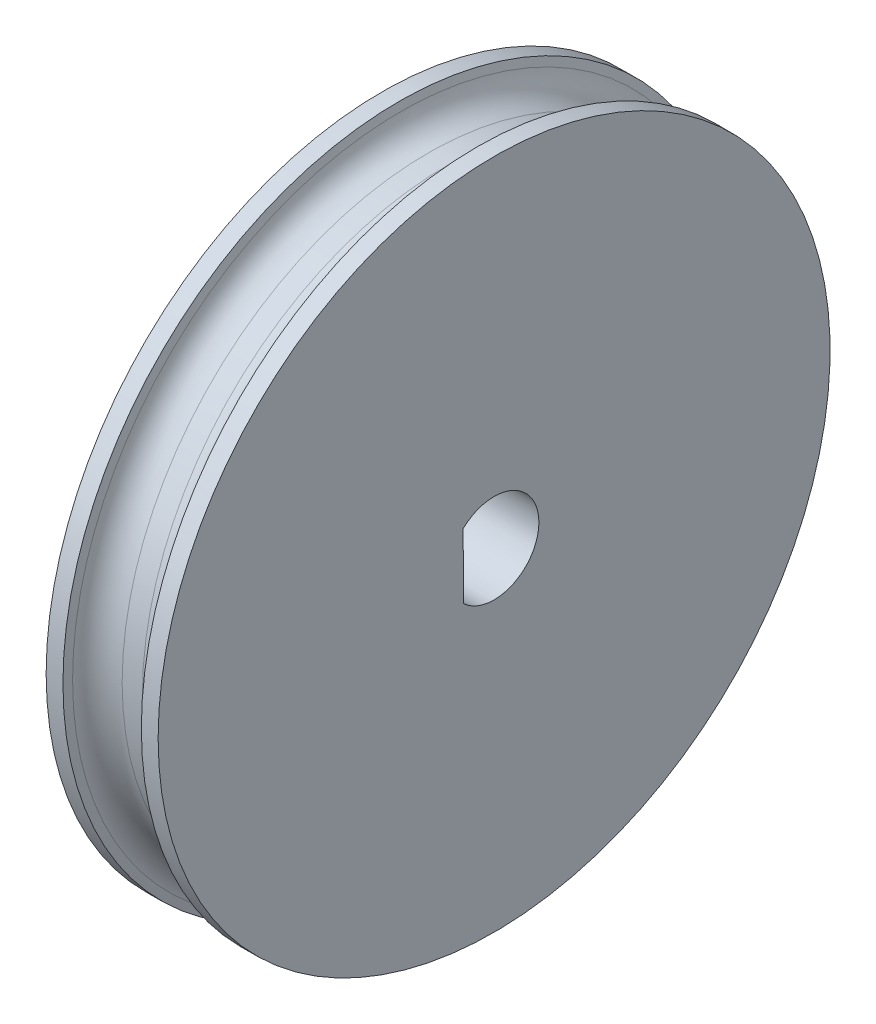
ISO-10303-21;
HEADER;
FILE_DESCRIPTION(('STEP AP214'),'2;1');
FILE_NAME('part.step','',(''),(''),'','','');
FILE_SCHEMA(('AUTOMOTIVE_DESIGN { 1 0 10303 214 1 1 1 1 }'));
ENDSEC;
DATA;
#1=APPLICATION_CONTEXT('core data for automotive mechanical design processes');
#2=APPLICATION_PROTOCOL_DEFINITION('international standard','automotive_design',2000,#1);
#3=PRODUCT_CONTEXT('',#1,'mechanical');
#4=PRODUCT('Part','Part','',(#3));
#5=PRODUCT_RELATED_PRODUCT_CATEGORY('part','',(#4));
#6=PRODUCT_DEFINITION_FORMATION('','',#4);
#7=PRODUCT_DEFINITION_CONTEXT('part definition',#1,'design');
#8=PRODUCT_DEFINITION('design','',#6,#7);
#9=PRODUCT_DEFINITION_SHAPE('','',#8);
#10=(LENGTH_UNIT() NAMED_UNIT(*) SI_UNIT(.MILLI.,.METRE.));
#11=(NAMED_UNIT(*) PLANE_ANGLE_UNIT() SI_UNIT($,.RADIAN.));
#12=(NAMED_UNIT(*) SI_UNIT($,.STERADIAN.) SOLID_ANGLE_UNIT());
#13=UNCERTAINTY_MEASURE_WITH_UNIT(LENGTH_MEASURE(1.E-05),#10,'distance_accuracy_value','');
#14=(GEOMETRIC_REPRESENTATION_CONTEXT(3) GLOBAL_UNCERTAINTY_ASSIGNED_CONTEXT((#13)) GLOBAL_UNIT_ASSIGNED_CONTEXT((#10,
#11,#12)) REPRESENTATION_CONTEXT('',''));
#15=CARTESIAN_POINT('',(0.,0.,0.));
#16=DIRECTION('',(0.,0.,1.));
#17=DIRECTION('',(1.,0.,0.));
#18=AXIS2_PLACEMENT_3D('',#15,#16,#17);
#19=CARTESIAN_POINT('',(-1.1712000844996,0.117251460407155,0.));
#20=DIRECTION('',(-1.,0.,0.));
#21=DIRECTION('',(0.,0.,1.));
#22=AXIS2_PLACEMENT_3D('',#19,#20,#21);
#23=CONICAL_SURFACE('',#22,10.9240376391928,1.36135681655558);
#24=CARTESIAN_POINT('',(-1.33956365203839,0.117251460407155,0.));
#25=DIRECTION('',(-1.,0.,0.));
#26=DIRECTION('',(0.,0.,1.));
#27=AXIS2_PLACEMENT_3D('',#24,#25,#26);
#28=CIRCLE('',#27,11.7161259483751);
#29=CARTESIAN_POINT('',(-1.33956365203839,0.117251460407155,11.7161259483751));
#30=VERTEX_POINT('',#29);
#31=EDGE_CURVE('E93',#30,#30,#28,.T.);
#32=ORIENTED_EDGE('',*,*,#31,.T.);
#33=EDGE_LOOP('',(#32));
#34=FACE_BOUND('',#33,.T.);
#35=CARTESIAN_POINT('',(-1.39990294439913,0.117251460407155,0.));
#36=DIRECTION('',(-1.,0.,0.));
#37=DIRECTION('',(0.,0.,1.));
#38=AXIS2_PLACEMENT_3D('',#35,#36,#37);
#39=CIRCLE('',#38,12.);
#40=CARTESIAN_POINT('',(-1.39990294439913,0.117251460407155,12.));
#41=VERTEX_POINT('',#40);
#42=EDGE_CURVE('E90',#41,#41,#39,.T.);
#43=ORIENTED_EDGE('',*,*,#42,.F.);
#44=EDGE_LOOP('',(#43));
#45=FACE_BOUND('',#44,.T.);
#46=ADVANCED_FACE('F35',(#34,#45),#23,.T.);
#47=CARTESIAN_POINT('',(-22.6859186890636,0.117251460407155,0.));
#48=DIRECTION('',(-1.,0.,0.));
#49=DIRECTION('',(0.,0.,1.));
#50=AXIS2_PLACEMENT_3D('',#47,#48,#49);
#51=CYLINDRICAL_SURFACE('',#50,12.);
#52=CARTESIAN_POINT('',(-1.99990294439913,0.117251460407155,0.));
#53=DIRECTION('',(-1.,0.,0.));
#54=DIRECTION('',(0.,0.,1.));
#55=AXIS2_PLACEMENT_3D('',#52,#53,#54);
#56=CIRCLE('',#55,12.);
#57=CARTESIAN_POINT('',(-1.99990294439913,0.117251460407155,12.));
#58=VERTEX_POINT('',#57);
#59=EDGE_CURVE('E87',#58,#58,#56,.T.);
#60=ORIENTED_EDGE('',*,*,#59,.F.);
#61=EDGE_LOOP('',(#60));
#62=FACE_BOUND('',#61,.T.);
#63=ORIENTED_EDGE('',*,*,#42,.T.);
#64=EDGE_LOOP('',(#63));
#65=FACE_BOUND('',#64,.T.);
#66=ADVANCED_FACE('F113',(#62,#65),#51,.T.);
#67=CARTESIAN_POINT('',(-1.99990294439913,0.117251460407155,0.));
#68=DIRECTION('',(1.,0.,0.));
#69=DIRECTION('',(0.,0.,-1.));
#70=AXIS2_PLACEMENT_3D('',#67,#68,#69);
#71=PLANE('',#70);
#72=CARTESIAN_POINT('',(-1.99990294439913,0.,0.));
#73=DIRECTION('',(1.,0.,0.));
#74=DIRECTION('',(0.,0.,-1.));
#75=AXIS2_PLACEMENT_3D('',#72,#73,#74);
#76=CIRCLE('',#75,4.5);
#77=CARTESIAN_POINT('',(-1.99990294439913,0.,-4.5));
#78=VERTEX_POINT('',#77);
#79=EDGE_CURVE('E43',#78,#78,#76,.F.);
#80=ORIENTED_EDGE('',*,*,#79,.F.);
#81=EDGE_LOOP('',(#80));
#82=FACE_BOUND('',#81,.T.);
#83=ORIENTED_EDGE('',*,*,#59,.T.);
#84=EDGE_LOOP('',(#83));
#85=FACE_BOUND('',#84,.T.);
#86=ADVANCED_FACE('F109',(#82,#85),#71,.F.);
#87=CARTESIAN_POINT('',(2.00009705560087,12.1172514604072,0.));
#88=DIRECTION('',(-1.,0.,0.));
#89=DIRECTION('',(0.,0.,1.));
#90=AXIS2_PLACEMENT_3D('',#87,#88,#89);
#91=PLANE('',#90);
#92=DIRECTION('',(0.,0.999991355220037,0.0041580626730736));
#93=VECTOR('',#92,1.);
#94=CARTESIAN_POINT('',(2.00009705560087,12.1124680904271,1.1503743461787));
#95=LINE('',#94,#93);
#96=CARTESIAN_POINT('',(2.00009705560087,-1.16645882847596,1.09515925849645));
#97=VERTEX_POINT('',#96);
#98=CARTESIAN_POINT('',(2.00009705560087,1.1573110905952,1.10482172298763));
#99=VERTEX_POINT('',#98);
#100=EDGE_CURVE('E66',#97,#99,#95,.T.);
#101=ORIENTED_EDGE('',*,*,#100,.T.);
#102=CARTESIAN_POINT('',(2.00009705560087,0.,0.));
#103=DIRECTION('',(-1.,0.,0.));
#104=DIRECTION('',(0.,0.,1.));
#105=AXIS2_PLACEMENT_3D('',#102,#103,#104);
#106=CIRCLE('',#105,1.6);
#107=EDGE_CURVE('E64',#99,#97,#106,.T.);
#108=ORIENTED_EDGE('',*,*,#107,.T.);
#109=EDGE_LOOP('',(#101,#108));
#110=FACE_BOUND('',#109,.T.);
#111=CARTESIAN_POINT('',(2.00009705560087,0.117251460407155,0.));
#112=DIRECTION('',(-1.,0.,0.));
#113=DIRECTION('',(0.,0.,1.));
#114=AXIS2_PLACEMENT_3D('',#111,#112,#113);
#115=CIRCLE('',#114,12.);
#116=CARTESIAN_POINT('',(2.00009705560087,0.117251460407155,12.));
#117=VERTEX_POINT('',#116);
#118=EDGE_CURVE('E84',#117,#117,#115,.T.);
#119=ORIENTED_EDGE('',*,*,#118,.F.);
#120=EDGE_LOOP('',(#119));
#121=FACE_BOUND('',#120,.T.);
#122=ADVANCED_FACE('F112',(#110,#121),#91,.F.);
#123=CARTESIAN_POINT('',(-22.6859186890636,0.117251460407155,0.));
#124=DIRECTION('',(-1.,0.,0.));
#125=DIRECTION('',(0.,0.,1.));
#126=AXIS2_PLACEMENT_3D('',#123,#124,#125);
#127=CYLINDRICAL_SURFACE('',#126,12.);
#128=CARTESIAN_POINT('',(1.40009705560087,0.117251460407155,0.));
#129=DIRECTION('',(-1.,0.,0.));
#130=DIRECTION('',(0.,0.,1.));
#131=AXIS2_PLACEMENT_3D('',#128,#129,#130);
#132=CIRCLE('',#131,12.);
#133=CARTESIAN_POINT('',(1.40009705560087,0.117251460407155,12.));
#134=VERTEX_POINT('',#133);
#135=EDGE_CURVE('E81',#134,#134,#132,.T.);
#136=ORIENTED_EDGE('',*,*,#135,.F.);
#137=EDGE_LOOP('',(#136));
#138=FACE_BOUND('',#137,.T.);
#139=ORIENTED_EDGE('',*,*,#118,.T.);
#140=EDGE_LOOP('',(#139));
#141=FACE_BOUND('',#140,.T.);
#142=ADVANCED_FACE('F150',(#138,#141),#127,.T.);
#143=CARTESIAN_POINT('',(1.40009705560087,0.117251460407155,0.));
#144=DIRECTION('',(1.,0.,0.));
#145=DIRECTION('',(0.,0.,-1.));
#146=AXIS2_PLACEMENT_3D('',#143,#144,#145);
#147=CONICAL_SURFACE('',#146,12.,1.36135681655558);
#148=CARTESIAN_POINT('',(1.33975776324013,0.117251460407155,0.));
#149=DIRECTION('',(1.,0.,0.));
#150=DIRECTION('',(0.,0.,-1.));
#151=AXIS2_PLACEMENT_3D('',#148,#149,#150);
#152=CIRCLE('',#151,11.7161259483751);
#153=CARTESIAN_POINT('',(1.33975776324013,0.117251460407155,-11.7161259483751));
#154=VERTEX_POINT('',#153);
#155=EDGE_CURVE('E102',#154,#154,#152,.T.);
#156=ORIENTED_EDGE('',*,*,#155,.T.);
#157=EDGE_LOOP('',(#156));
#158=FACE_BOUND('',#157,.T.);
#159=ORIENTED_EDGE('',*,*,#135,.T.);
#160=EDGE_LOOP('',(#159));
#161=FACE_BOUND('',#160,.T.);
#162=ADVANCED_FACE('F144',(#158,#161),#147,.T.);
#163=CARTESIAN_POINT('',(-22.6859186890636,0.117251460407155,0.));
#164=DIRECTION('',(-1.,0.,0.));
#165=DIRECTION('',(0.,0.,1.));
#166=AXIS2_PLACEMENT_3D('',#163,#164,#165);
#167=CYLINDRICAL_SURFACE('',#166,10.9240376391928);
#168=CARTESIAN_POINT('',(-0.361416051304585,0.117251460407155,0.));
#169=DIRECTION('',(-1.,0.,0.));
#170=DIRECTION('',(0.,0.,1.));
#171=AXIS2_PLACEMENT_3D('',#168,#169,#170);
#172=CIRCLE('',#171,10.9240376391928);
#173=CARTESIAN_POINT('',(-0.361416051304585,0.117251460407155,10.9240376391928));
#174=VERTEX_POINT('',#173);
#175=EDGE_CURVE('E99',#174,#174,#172,.F.);
#176=ORIENTED_EDGE('',*,*,#175,.T.);
#177=EDGE_LOOP('',(#176));
#178=FACE_BOUND('',#177,.T.);
#179=CARTESIAN_POINT('',(0.361610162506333,0.117251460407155,0.));
#180=DIRECTION('',(-1.,0.,0.));
#181=DIRECTION('',(0.,0.,1.));
#182=AXIS2_PLACEMENT_3D('',#179,#180,#181);
#183=CIRCLE('',#182,10.9240376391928);
#184=CARTESIAN_POINT('',(0.361610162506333,0.117251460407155,10.9240376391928));
#185=VERTEX_POINT('',#184);
#186=EDGE_CURVE('E96',#185,#185,#183,.T.);
#187=ORIENTED_EDGE('',*,*,#186,.T.);
#188=EDGE_LOOP('',(#187));
#189=FACE_BOUND('',#188,.T.);
#190=ADVANCED_FACE('F131',(#178,#189),#167,.T.);
#191=CARTESIAN_POINT('',(-0.361416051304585,0.117251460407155,0.));
#192=DIRECTION('',(-1.,0.,0.));
#193=DIRECTION('',(0.,0.,1.));
#194=AXIS2_PLACEMENT_3D('',#191,#192,#193);
#195=TOROIDAL_SURFACE('',#194,11.9240376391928,1.);
#196=ORIENTED_EDGE('',*,*,#175,.F.);
#197=EDGE_LOOP('',(#196));
#198=FACE_BOUND('',#197,.T.);
#199=ORIENTED_EDGE('',*,*,#31,.F.);
#200=EDGE_LOOP('',(#199));
#201=FACE_BOUND('',#200,.T.);
#202=ADVANCED_FACE('F128',(#198,#201),#195,.F.);
#203=CARTESIAN_POINT('',(0.361610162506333,0.117251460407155,0.));
#204=DIRECTION('',(-1.,0.,0.));
#205=DIRECTION('',(0.,0.,1.));
#206=AXIS2_PLACEMENT_3D('',#203,#204,#205);
#207=TOROIDAL_SURFACE('',#206,11.9240376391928,1.);
#208=ORIENTED_EDGE('',*,*,#155,.F.);
#209=EDGE_LOOP('',(#208));
#210=FACE_BOUND('',#209,.T.);
#211=ORIENTED_EDGE('',*,*,#186,.F.);
#212=EDGE_LOOP('',(#211));
#213=FACE_BOUND('',#212,.T.);
#214=ADVANCED_FACE('F130',(#210,#213),#207,.F.);
#215=CARTESIAN_POINT('',(-2.49990294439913,0.,0.));
#216=DIRECTION('',(-1.,0.,0.));
#217=DIRECTION('',(0.,0.,1.));
#218=AXIS2_PLACEMENT_3D('',#215,#216,#217);
#219=PLANE('',#218);
#220=CARTESIAN_POINT('',(-2.49990294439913,0.,0.));
#221=DIRECTION('',(-1.,0.,0.));
#222=DIRECTION('',(0.,0.,1.));
#223=AXIS2_PLACEMENT_3D('',#220,#221,#222);
#224=CIRCLE('',#223,1.6);
#225=CARTESIAN_POINT('',(-2.49990294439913,1.1573110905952,1.10482172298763));
#226=VERTEX_POINT('',#225);
#227=CARTESIAN_POINT('',(-2.49990294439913,-1.16645882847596,1.09515925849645));
#228=VERTEX_POINT('',#227);
#229=EDGE_CURVE('E57',#226,#228,#224,.T.);
#230=ORIENTED_EDGE('',*,*,#229,.F.);
#231=DIRECTION('',(0.,0.999991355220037,0.0041580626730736));
#232=VECTOR('',#231,1.);
#233=CARTESIAN_POINT('',(-2.49990294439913,-1.16645882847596,1.09515925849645));
#234=LINE('',#233,#232);
#235=EDGE_CURVE('E70',#228,#226,#234,.T.);
#236=ORIENTED_EDGE('',*,*,#235,.F.);
#237=EDGE_LOOP('',(#230,#236));
#238=FACE_BOUND('',#237,.T.);
#239=CARTESIAN_POINT('',(-2.49990294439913,0.,0.));
#240=DIRECTION('',(-1.,0.,0.));
#241=DIRECTION('',(0.,0.,1.));
#242=AXIS2_PLACEMENT_3D('',#239,#240,#241);
#243=CIRCLE('',#242,4.);
#244=CARTESIAN_POINT('',(-2.49990294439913,0.,4.));
#245=VERTEX_POINT('',#244);
#246=EDGE_CURVE('E11',#245,#245,#243,.T.);
#247=ORIENTED_EDGE('',*,*,#246,.T.);
#248=EDGE_LOOP('',(#247));
#249=FACE_BOUND('',#248,.T.);
#250=ADVANCED_FACE('F74',(#238,#249),#219,.T.);
#251=CARTESIAN_POINT('',(-1.99990294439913,0.,0.));
#252=DIRECTION('',(-1.,0.,0.));
#253=DIRECTION('',(0.,0.,1.));
#254=AXIS2_PLACEMENT_3D('',#251,#252,#253);
#255=TOROIDAL_SURFACE('',#254,4.,0.5);
#256=ORIENTED_EDGE('',*,*,#79,.T.);
#257=EDGE_LOOP('',(#256));
#258=FACE_BOUND('',#257,.T.);
#259=ORIENTED_EDGE('',*,*,#246,.F.);
#260=EDGE_LOOP('',(#259));
#261=FACE_BOUND('',#260,.T.);
#262=ADVANCED_FACE('F37',(#258,#261),#255,.T.);
#263=CARTESIAN_POINT('',(7.50009705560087,0.,0.));
#264=DIRECTION('',(-1.,0.,0.));
#265=DIRECTION('',(0.,0.,1.));
#266=AXIS2_PLACEMENT_3D('',#263,#264,#265);
#267=CYLINDRICAL_SURFACE('',#266,1.6);
#268=DIRECTION('',(-1.,0.,0.));
#269=VECTOR('',#268,1.);
#270=CARTESIAN_POINT('',(7.50009705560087,1.1573110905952,1.10482172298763));
#271=LINE('',#270,#269);
#272=EDGE_CURVE('E50',#99,#226,#271,.T.);
#273=ORIENTED_EDGE('',*,*,#272,.T.);
#274=ORIENTED_EDGE('',*,*,#229,.T.);
#275=DIRECTION('',(-1.,0.,0.));
#276=VECTOR('',#275,1.);
#277=CARTESIAN_POINT('',(7.50009705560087,-1.16645882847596,1.09515925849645));
#278=LINE('',#277,#276);
#279=EDGE_CURVE('E67',#97,#228,#278,.T.);
#280=ORIENTED_EDGE('',*,*,#279,.F.);
#281=ORIENTED_EDGE('',*,*,#107,.F.);
#282=EDGE_LOOP('',(#273,#274,#280,#281));
#283=FACE_BOUND('',#282,.T.);
#284=ADVANCED_FACE('F62',(#283),#267,.F.);
#285=CARTESIAN_POINT('',(7.50009705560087,-1.16645882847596,1.09515925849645));
#286=DIRECTION('',(0.,-0.0041580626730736,0.999991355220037));
#287=DIRECTION('',(0.,-0.999991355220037,-0.0041580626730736));
#288=AXIS2_PLACEMENT_3D('',#285,#286,#287);
#289=PLANE('',#288);
#290=ORIENTED_EDGE('',*,*,#279,.T.);
#291=ORIENTED_EDGE('',*,*,#235,.T.);
#292=ORIENTED_EDGE('',*,*,#272,.F.);
#293=ORIENTED_EDGE('',*,*,#100,.F.);
#294=EDGE_LOOP('',(#290,#291,#292,#293));
#295=FACE_BOUND('',#294,.T.);
#296=ADVANCED_FACE('F71',(#295),#289,.F.);
#297=CLOSED_SHELL('',(#46,#66,#86,#122,#142,#162,#190,#202,#214,#250,#262,#284,#296));
#298=MANIFOLD_SOLID_BREP('B2',#297);
#299=ADVANCED_BREP_SHAPE_REPRESENTATION('',(#18,#298),#14);
#300=SHAPE_DEFINITION_REPRESENTATION(#9,#299);
ENDSEC;
END-ISO-10303-21;
